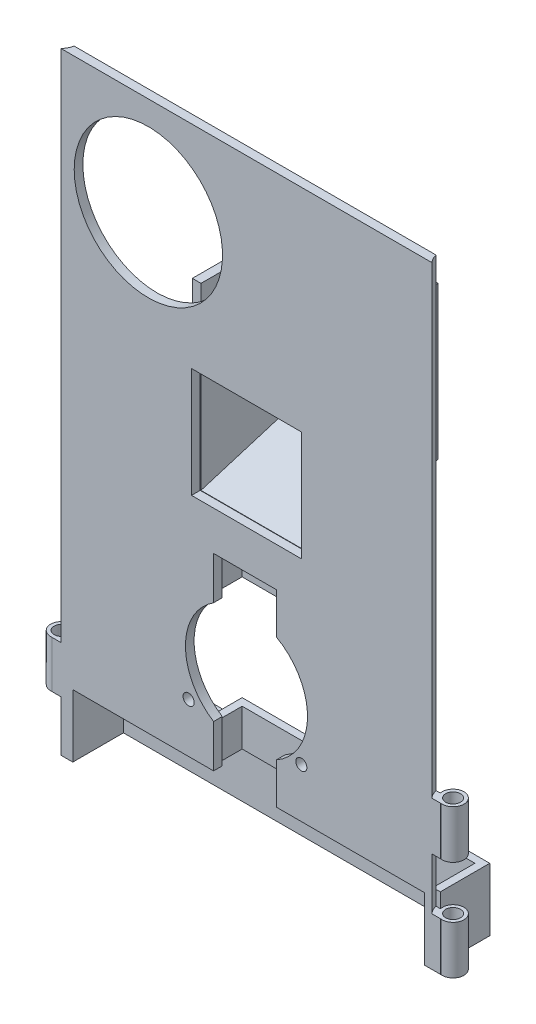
from build123d import *

# Parameters (mm, degrees)
SKETCH1_W                        = 62.865
SKETCH1_H                        = 99.06
BOSS_EXTRUDE1_DEPTH              = 1.4
SKETCH2_R                        = 1.75
BOSS_EXTRUDE2_DEPTH              = 99.06
TUBE_HOLE_DEPTH                  = 109.587853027
TUBE_HOLE_DEPTH_BACK             = 109.587853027
SKETCH7_R                        = 1.2
SKETCH8_R                        = 12
SKETCH8_W                        = 17.78
SKETCH8_H                        = 17.78
PANEL_HOLES_DEPTH                = 4.2
CUT_EXTRUDE1_DEPTH               = 4.2
CUT_EXTRUDE1_DEPTH_BACK          = 4.2
SKETCH9_R                        = 2.4
CUT_EXTRUDE2_START               = 12
SKETCH10_R                       = 2.4
CUT_EXTRUDE2_DEPTH               = 75.06
CUT_EXTRUDE3_START               = -3.8
SKETCH11_R                       = 2.4
CUT_EXTRUDE3_DEPTH               = 8.2
CUT_EXTRUDE4_START               = 87.06
SKETCH12_R                       = 2.4
CUT_EXTRUDE4_DEPTH               = 83.26
SKETCH13_W                       = 20.58
SKETCH13_H                       = 30.48
BOSS_EXTRUDE3_DEPTH              = 19.18
CUT_EXTRUDE5_DEPTH               = 110.914956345
CUT_EXTRUDE6_REACH               = 105.194
CUT_EXTRUDE6_OFFSET_FROM_SURFACE = 1.4
SKETCH14_W                       = 17.78
SKETCH14_H                       = 17.78
SKETCH16_W                       = 13.71246407
SKETCH16_H                       = 6
BOSS_EXTRUDE4_DEPTH              = 5
SKETCH17_W                       = 11.31246407
SKETCH17_H                       = 3.8
CUT_EXTRUDE7_DEPTH               = 90.494281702
SKETCH18_W                       = 59.276015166
SKETCH18_H                       = 10.16
BOSS_EXTRUDE5_DEPTH              = 8
SKETCH19_W                       = 56.876015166
SKETCH19_H                       = 9.973553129
CUT_EXTRUDE8_DEPTH               = 10.16
SKETCH20_R                       = 0.9
CUT_EXTRUDE9_DEPTH               = 8


with BuildPart() as part:
    # Sketch1 → Boss-Extrude1 (new body)
    with BuildSketch(Plane.XY):
        with Locations((31.4325, 49.53)):
            Rectangle(SKETCH1_W, SKETCH1_H)
    extrude(amount=BOSS_EXTRUDE1_DEPTH)

    # Sketch2 → Boss-Extrude2 (add)
    with BuildSketch(Plane(origin=(0, 0, 0), x_dir=(1, 0, 0), z_dir=(0, 1, 0))):
        with Locations((-0.25, 0.35)):
            Circle(SKETCH2_R)
        with Locations((63.115, 0.35)):
            Circle(SKETCH2_R)
    extrude(amount=BOSS_EXTRUDE2_DEPTH)

    # Sketch7 → Tube Hole (cut, two sides: drawn at the far end of the back side and taken through both)
    with BuildSketch(Plane(origin=(0, 12, 0), x_dir=(1, 0, 0), z_dir=(0, 1, 0)).offset(-TUBE_HOLE_DEPTH_BACK)):
        with Locations(Location((-0.25, 0.35, 0), (0, 0, 270))):
            Circle(SKETCH7_R)
        with Locations(Location((63.115, 0.35, 0), (0, 0, 90))):
            Circle(SKETCH7_R)
    extrude(amount=TUBE_HOLE_DEPTH + TUBE_HOLE_DEPTH_BACK, mode=Mode.SUBTRACT)

    # Sketch8 → Panel Holes (cut)
    with BuildSketch(Plane(origin=(0, 0, 0), x_dir=(-1, 0, 0), z_dir=(0, 0, -1))):
        with Locations((-15.5525, 83.18)):
            Circle(SKETCH8_R)
        with BuildLine():
            Line((-36.267227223, 16.786429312), (-36.267227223, 10.16))
            Line((-36.267227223, 10.16), (-26.107227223, 10.16))
            Line((-26.107227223, 10.16), (-26.107227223, 17.080765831))
            ThreePointArc((-26.107227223, 17.080765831), (-21.554838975, 25.4), (-26.107227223, 33.719234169))
            Line((-26.107227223, 33.719234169), (-26.107227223, 40.64))
            Line((-26.107227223, 40.64), (-36.267227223, 40.64))
            Line((-36.267227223, 40.64), (-36.267227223, 34.013570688))
            ThreePointArc((-36.267227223, 34.013570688), (-41.310161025, 25.4), (-36.267227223, 16.786429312))
        make_face()
        with Locations((-31.4325, 55.88)):
            Rectangle(SKETCH8_W, SKETCH8_H)
    extrude(amount=-PANEL_HOLES_DEPTH, mode=Mode.SUBTRACT)

    # Sketch9 → Cut-Extrude1 (cut, two sides: drawn at the far end of the back side and taken through both)
    with BuildSketch(Plane(origin=(0, 12, 0), x_dir=(1, 0, 0), z_dir=(0, 1, 0)).offset(-CUT_EXTRUDE1_DEPTH_BACK)):
        with Locations((63.115, 0.35)):
            Circle(SKETCH9_R)
    extrude(amount=CUT_EXTRUDE1_DEPTH + CUT_EXTRUDE1_DEPTH_BACK, mode=Mode.SUBTRACT)

    # Sketch10 → Cut-Extrude2 (cut)
    with BuildSketch(Plane(origin=(0, 12, 0), x_dir=(1, 0, 0), z_dir=(0, 1, 0)).offset(CUT_EXTRUDE2_START)):
        with Locations((63.115, 0.35)):
            Circle(SKETCH10_R)
    extrude(amount=CUT_EXTRUDE2_DEPTH, mode=Mode.SUBTRACT)

    # Sketch11 → Cut-Extrude3 (cut)
    with BuildSketch(Plane(origin=(0, 12, 0), x_dir=(1, 0, 0), z_dir=(0, 1, 0)).offset(CUT_EXTRUDE3_START)):
        with Locations((-0.25, 0.35)):
            Circle(SKETCH11_R)
    extrude(amount=-CUT_EXTRUDE3_DEPTH, mode=Mode.SUBTRACT)

    # Sketch12 → Cut-Extrude4 (cut)
    with BuildSketch(Plane(origin=(0, 12, 0), x_dir=(1, 0, 0), z_dir=(0, 1, 0)).offset(CUT_EXTRUDE4_START)):
        with Locations((-0.25, 0.35)):
            Circle(SKETCH12_R)
    extrude(amount=-CUT_EXTRUDE4_DEPTH, mode=Mode.SUBTRACT)

    # Sketch13 → Boss-Extrude3 (add)
    with BuildSketch(Plane(origin=(0, 0, 0), x_dir=(-1, 0, 0), z_dir=(0, 0, -1))):
        with Locations((-31.559798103, 60.83)):
            Rectangle(SKETCH13_W, SKETCH13_H)
    extrude(amount=BOSS_EXTRUDE3_DEPTH)

    # Sketch15 → Cut-Extrude5 (cut, through all)
    with BuildSketch(Plane.ZY.offset(-21.269798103)):
        Polygon((-19.18, 51.432), (0, 45.59), (-19.18, 45.59), align=None)
    extrude(amount=-CUT_EXTRUDE5_DEPTH, mode=Mode.SUBTRACT)

    # Cut-Extrude6: up to this face of the body (flat: up to its plane, moved by the offset)
    cut_extrude6_end = Plane(part.part.faces().sort_by_distance((31.559798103, 48.511, -9.59))[0]).offset(-CUT_EXTRUDE6_OFFSET_FROM_SURFACE)
    # Sketch14 → Cut-Extrude6 (cut, up to the picked face)
    with BuildSketch(Plane(origin=(0, 76.07, 0), x_dir=(1, 0, 0), z_dir=(0, 1, 0)), mode=Mode.PRIVATE) as cut_extrude6_sk1:
        with Locations((31.559798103, 8.89)):
            Rectangle(SKETCH14_W, SKETCH14_H)
    cut_extrude6_tool1 = split(extrude(cut_extrude6_sk1.sketch, amount=-CUT_EXTRUDE6_REACH, mode=Mode.PRIVATE), bisect_by=cut_extrude6_end, keep=Keep.BOTH, mode=Mode.PRIVATE)
    add(cut_extrude6_tool1.solids().sort_by(Axis((31.559798, 76.07, -8.89), (0, -1, 0)))[0], mode=Mode.SUBTRACT)

    # Sketch16 → Boss-Extrude4 (add)
    with BuildSketch(Plane(origin=(0, 0, 0), x_dir=(-1, 0, 0), z_dir=(0, 0, -1))):
        with Locations((-31.187227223, 37.460632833)):
            Rectangle(SKETCH16_W, SKETCH16_H)
        with Locations((-31.187227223, 13.339367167)):
            Rectangle(SKETCH16_W, SKETCH16_H)
    extrude(amount=BOSS_EXTRUDE4_DEPTH)

    # Sketch17 → Cut-Extrude7 (cut, through all)
    with BuildSketch(Plane(origin=(0, 40.460632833, 0), x_dir=(1, 0, 0), z_dir=(0, 1, 0))):
        with Locations((31.187227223, 1.9)):
            Rectangle(SKETCH17_W, SKETCH17_H)
    extrude(amount=-CUT_EXTRUDE7_DEPTH, mode=Mode.SUBTRACT)

    # Sketch18 → Boss-Extrude5 (add)
    with BuildSketch(Plane(origin=(0, 0, 0), x_dir=(-1, 0, 0), z_dir=(0, 0, -1))):
        with Locations((-31.762349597, 5.08)):
            Rectangle(SKETCH18_W, SKETCH18_H)
    extrude(amount=BOSS_EXTRUDE5_DEPTH)

    # Sketch19 → Cut-Extrude8 (cut)
    with BuildSketch(Plane.XZ):
        with Locations((31.762349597, -1.813223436)):
            Rectangle(SKETCH19_W, SKETCH19_H)
    extrude(amount=-CUT_EXTRUDE8_DEPTH, mode=Mode.SUBTRACT)

    # Sketch20 → Cut-Extrude9 (cut)
    with BuildSketch(Plane.XY.offset(1.4)):
        with Locations((40.306100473, 18.16)):
            Circle(SKETCH20_R)
        with Locations(Location((22.068353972, 18.16, 0), (0, 0, 180))):
            Circle(SKETCH20_R)
    extrude(amount=-CUT_EXTRUDE9_DEPTH, mode=Mode.SUBTRACT)


solid = part.part
